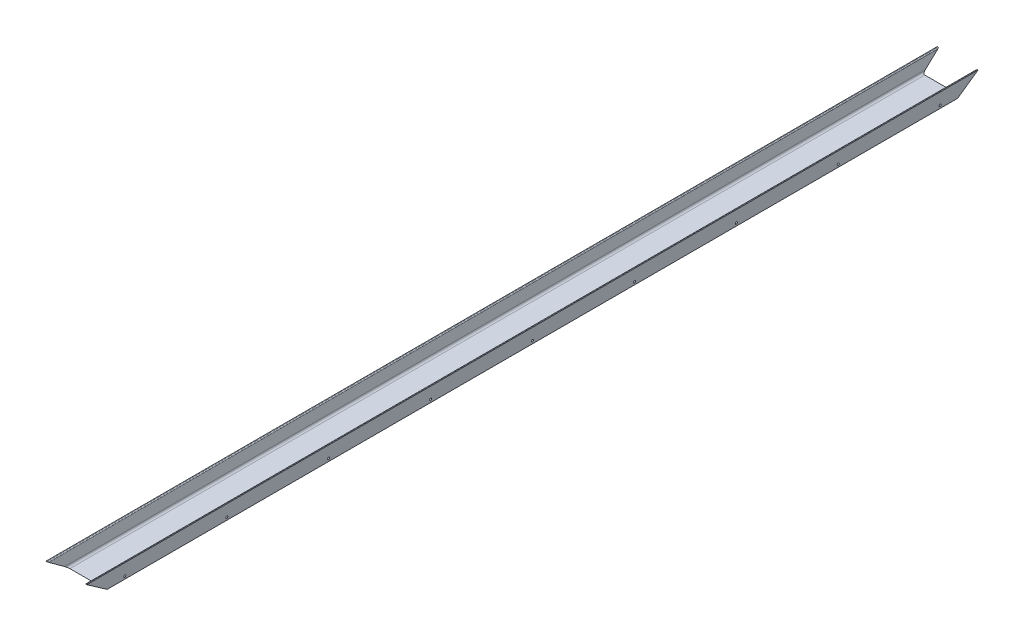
from build123d import *

# Parameters (mm, degrees)
STRUCTURAL_MEMBER1_DEPTH        = 2776.728
CUT_EXTRUDE1_DEPTH              = 1391.526033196
CUT_EXTRUDE1_DEPTH_BACK         = 1391.526033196
F_1_4_0_25_DIAMETER_HOLE1_D     = 6.35
F_1_4_0_25_DIAMETER_HOLE1_DEPTH = 25.4
LPATTERN1_COUNT                 = 9
LPATTERN1_PITCH                 = 317.5


with BuildPart() as part:
    # Sketch1 → Structural Member1 (new body)
    with BuildSketch(Plane(origin=(0, 0, -1388.364), x_dir=(0, 1, 0), z_dir=(0, 0, 1))):
        with BuildLine():
            Line((0, -63.5), (0, 63.5))
            Line((0, 63.5), (44.45, 63.5))
            Line((44.45, 63.5), (44.45, 61.04128))
            ThreePointArc((44.45, 61.04128), (43.787888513, 59.23532115), (42.115363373, 58.285300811))
            Line((42.115363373, 58.285300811), (10.980951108, 53.095853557))
            ThreePointArc((10.980951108, 53.095853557), (6.571566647, 50.591254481), (4.826, 45.83009024))
            Line((4.826, 45.83009024), (4.826, -45.83009024))
            ThreePointArc((4.826, -45.83009024), (6.571566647, -50.591254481), (10.980951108, -53.095853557))
            Line((10.980951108, -53.095853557), (42.115363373, -58.285300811))
            ThreePointArc((42.115363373, -58.285300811), (43.787888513, -59.23532115), (44.45, -61.04128))
            Line((44.45, -61.04128), (44.45, -63.5))
            Line((44.45, -63.5), (0, -63.5))
        make_face()
    extrude(amount=STRUCTURAL_MEMBER1_DEPTH)

    # Sketch12 → Cut-Extrude1 (cut, two sides: drawn at the far end of the back side and taken through both)
    with BuildSketch(Plane(origin=(0, 0, 0), x_dir=(0, 0, -1), z_dir=(1, 0, 0)).offset(-CUT_EXTRUDE1_DEPTH_BACK)):
        Polygon((-1388.364, 44.45), (-1324.8828211, 0), (-1388.364, 0), align=None)
        Polygon((1388.364, 0), (1324.8828211, 0), (1388.364, 44.45), align=None)
    extrude(amount=CUT_EXTRUDE1_DEPTH + CUT_EXTRUDE1_DEPTH_BACK, mode=Mode.SUBTRACT)

    # 1_4 _0.25_ Diameter Hole1
    with Locations(Plane(origin=(63.5, 0, 0), x_dir=(0, 0, -1), z_dir=(1, 0, 0))):
        with Locations((-1269.534483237, 8.382)):
            f_1_4_0_25_diameter_hole1 = Hole(F_1_4_0_25_DIAMETER_HOLE1_D / 2, depth=F_1_4_0_25_DIAMETER_HOLE1_DEPTH)

    # LPattern1: 1_4 _0.25_ Diameter Hole1 ×9
    with Locations(*[(0, 0, -i * LPATTERN1_PITCH) for i in range(1, LPATTERN1_COUNT)]):
        add(f_1_4_0_25_diameter_hole1, mode=Mode.SUBTRACT)


solid = part.part
